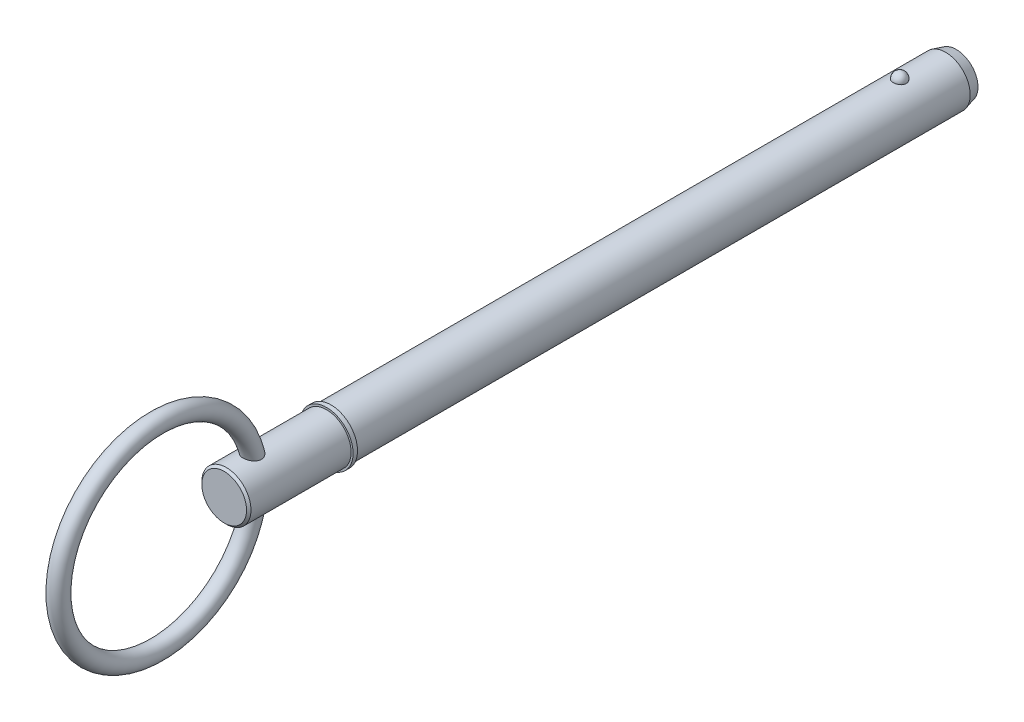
from build123d import *

# Parameters (mm, degrees)
SKETCH2_R           = 5.555
BOSS_EXTRUDE1_DEPTH = 127
BOSS_EXTRUDE2_START = 14.27
SKETCH3_R           = 5.555
BOSS_EXTRUDE2_DEPTH = 14.27
CHAMFER1_SIZE       = 2.4
CHAMFER1_SIZE2      = 0.643078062
SKETCH20_W          = 1
SKETCH20_H          = 6
SKETCH21_R          = 5.555
BOSS_EXTRUDE3_DEPTH = 24.13
CHAMFER2_SIZE       = 0.5
SKETCH24_R          = 2


with BuildPart() as part:
    # Sketch2 → Boss-Extrude1 (new body)
    with BuildSketch(Plane.XY):
        Circle(SKETCH2_R)
    extrude(amount=BOSS_EXTRUDE1_DEPTH)

    # Sketch3 → Boss-Extrude2 (add)
    with BuildSketch(Plane(origin=(0, 0, 0), x_dir=(-1, 0, 0), z_dir=(0, 0, -1)).offset(BOSS_EXTRUDE2_START)):
        Circle(SKETCH3_R)
    extrude(amount=-BOSS_EXTRUDE2_DEPTH)

    # Chamfer1
    chamfer1_edges = [part.edges().sort_by_distance(p)[0] for p in [
        (5.555, 0, -14.27),
    ]]
    chamfer1_side = [part.faces().sort_by_distance(p)[0] for p in [
        (5.555, 0, -7.135),
    ]]
    chamfer(chamfer1_edges, length=CHAMFER1_SIZE, length2=CHAMFER1_SIZE2, reference=chamfer1_side[0])

    # Sketch18 → Revolve1 (revolve)
    with BuildSketch(Plane(origin=(0, 0, 0), x_dir=(0, 0, -1), z_dir=(1, 0, 0))):
        with BuildLine():
            Line((1.49, 7.045), (1.49, 4.065))
            ThreePointArc((1.49, 4.065), (0, 5.555), (1.49, 7.045))
        make_face()
    revolve(axis=Axis((0, 7.045, -1.49), (0, -1, 0)))

    # Sketch20 → Revolve2 (revolve)
    with BuildSketch(Plane(origin=(0, 0, 0), x_dir=(0, 0, -1), z_dir=(1, 0, 0)), mode=Mode.PRIVATE) as revolve2_sk:
        with Locations((-127.5, 3)):
            Rectangle(SKETCH20_W, SKETCH20_H)
    revolve(revolve2_sk.sketch.rotate(Axis((0, 0, 33.728787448), (0, 0, 1)), 270), axis=Axis((0, 0, 33.728787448), (0, 0, 1)))

    # Sketch21 → Boss-Extrude3 (add)
    with BuildSketch(Plane(origin=(0, 0, 127), x_dir=(-1, 0, 0), z_dir=(0, 0, -1))):
        with Locations(Location((0, 0, 0), (0, 0, 180))):
            Circle(SKETCH21_R)
    extrude(amount=-BOSS_EXTRUDE3_DEPTH)

    # Chamfer2
    chamfer2_edges = [part.edges().sort_by_distance(p)[0] for p in [
        (-5.555, 0, 151.13),
    ]]
    chamfer(chamfer2_edges, length=CHAMFER2_SIZE)

    # Sweep1: sweep along a path in Sketch23
    with BuildLine(Plane(origin=(0, 0, 0), x_dir=(0, 0, -1), z_dir=(1, 0, 0))) as sweep1_path:
        CenterArc((-166.355, 0), 22.225, 0, 360)
    # Sketch24 → Sweep1 (sweep)
    with BuildSketch(Plane(origin=(0, 0, 0), x_dir=(1, 0, 0), z_dir=(0, 1, 0))):
        with Locations((0, -144.13)):
            Circle(SKETCH24_R)
    sweep(path=sweep1_path.line)


solid = part.part
